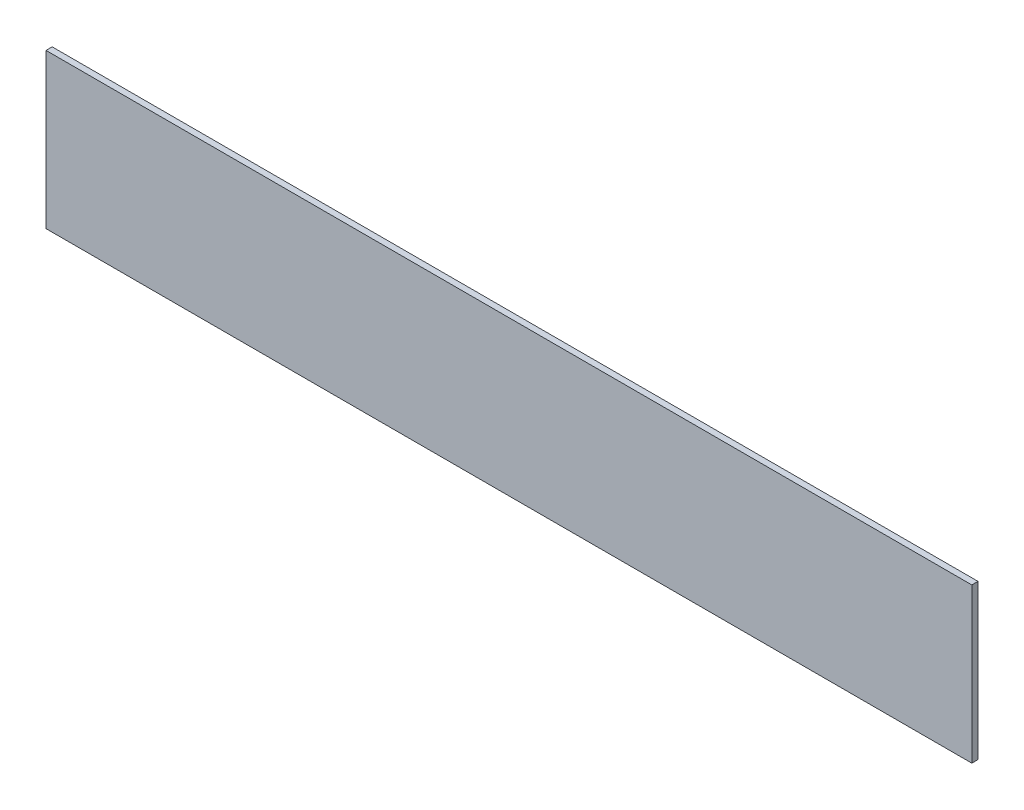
from build123d import *

# Parameters (mm, degrees)
ESBO_O2_W                = 599.75
ESBO_O2_H                = 100
RESSALTO_EXTRUS_O1_DEPTH = 4


with BuildPart() as part:
    # Esbo_o2 → Ressalto-extrus_o1 (new body)
    with BuildSketch(Plane.XY):
        with Locations((-299.875, 359.63253177)):
            Rectangle(ESBO_O2_W, ESBO_O2_H)
    extrude(amount=RESSALTO_EXTRUS_O1_DEPTH)


solid = part.part
